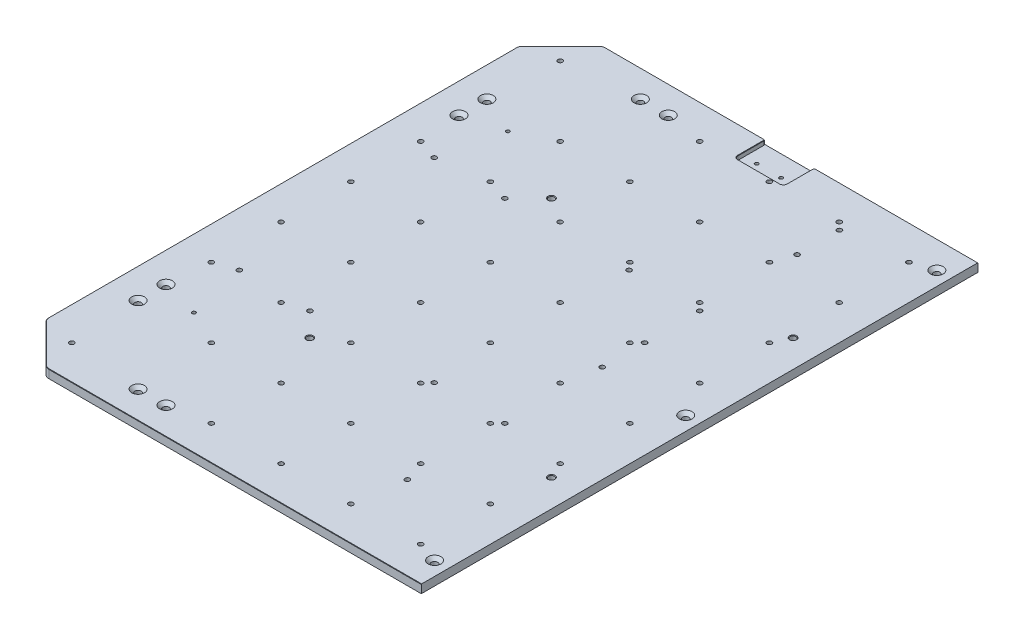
from build123d import *

# Parameters (mm, degrees)
AUFSATZ_LINEAR_AUSTRAGEN1_DEPTH                      = 12
VERRUNDUNG1_R                                        = 10
M8_GEWINDEBOHRUNG2_D                                 = 6.8
M8_GEWINDEBOHRUNG3_D                                 = 6.8
LINEARES_MUSTER1_COUNT                               = 12
LINEARES_MUSTER1_PITCH                               = 100
LINEARES_MUSTER1_COUNT_DIR2                          = 8
LINEARES_MUSTER1_PITCH_DIR2                          = 100
SKIZZE16_R                                           = 6
AUFSATZ_LINEAR_AUSTRAGEN2_DEPTH                      = 12
FORMSENKUNG_F_R_M8_SENKSCHRAUBE_MIT_INNE_D           = 9
FORMSENKUNG_F_R_M8_SENKSCHRAUBE_MIT_INNE_CSINK_D     = 18.25
FORMSENKUNG_F_R_M8_SENKSCHRAUBE_MIT_INNE_CSINK_ANGLE = 90
SCHNITT_LINEAR_AUSTRAGEN1_DEPTH                      = 719.991655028
M5_GEWINDEBOHRUNG1_D                                 = 4.2
M5_GEWINDEBOHRUNG1_DEPTH                             = 12
M5_GEWINDEBOHRUNG1_TIP                               = 1.2618073
SCHNITT_LINEAR_AUSTRAGEN2_DEPTH                      = 6
VERRUNDUNG2_R                                        = 2
M6_GEWINDEBOHRUNG1_D                                 = 5
F_5_0MM_STIFTLOCH1_D                                 = 5
F_5_0MM_STIFTLOCH1_DEPTH                             = 8
F_5_0MM_STIFTLOCH1_TIP                               = 1.502151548
FASE1_SIZE                                           = 0.5
HORST900_MITTE_M8_GEWINDEBOHRUNG13_D                 = 6.8
HORST900_LINKS_M8_GEWINDEBOHRUNG_COUNT               = 2
HORST900_LINKS_M8_GEWINDEBOHRUNG_PITCH               = 279.31
HORST900_MITTE_VORNE_M8_GEWINDEBOHRUNG15_D           = 6.8
LINEARES_MUSTER7_COUNT                               = 2
LINEARES_MUSTER7_PITCH                               = 279.31
LINEARES_MUSTER8_COUNT                               = 2
LINEARES_MUSTER8_PITCH                               = 340
HORST1400_M10_GEWINDEBOHRUNG1_D                      = 8.5
HORST1400_M10_GEWINDEBOHRUNG1_DEPTH                  = 27.5
HORST1400_M10_GEWINDEBOHRUNG1_CSINK_D                = 10.05
HORST1400_M10_GEWINDEBOHRUNG1_CSINK_ANGLE            = 90
HORST1400_M10_GEWINDEBOHRUNG1_TIP                    = 2.553657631


with BuildPart() as part:
    # Skizze1 → Aufsatz-Linear austragen1 (new body)
    with BuildSketch(Plane(origin=(0, 0, 0), x_dir=(1, 0, 0), z_dir=(0, 1, 0))):
        Polygon((-538, 399), (-598, 339), (-598, -339), (-538, -399), (538, -399), (598, -339), (598, 339), (538, 399), align=None)
    extrude(amount=AUFSATZ_LINEAR_AUSTRAGEN1_DEPTH)

    # Verrundung1
    verrundung1_edges = [part.edges().sort_by_distance(p)[0] for p in [
        (598, 6, -339),
        (598, 6, 339),
        (538, 6, 399),
        (-538, 6, 399),
        (-598, 6, 339),
        (-598, 6, -339),
        (-538, 6, -399),
        (538, 6, -399),
    ]]
    fillet(verrundung1_edges, radius=VERRUNDUNG1_R)

    # M8 Gewindebohrung2 (through all)
    with Locations(Plane(origin=(0, 12, 0), x_dir=(1, 0, 0), z_dir=(0, 1, 0))):
        with Locations((520.153589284, -139.653589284), (520.153589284, 139.653589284), (240.846410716, -139.653589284), (240.846410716, 139.653589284)):
            m8_gewindebohrung2 = Hole(M8_GEWINDEBOHRUNG2_D / 2)

    # M8 Gewindebohrung3 (through all)
    with Locations(Plane(origin=(0, 12, 0), x_dir=(1, 0, 0), z_dir=(0, 1, 0))):
        with Locations((-550, -350)):
            m8_gewindebohrung3 = Hole(M8_GEWINDEBOHRUNG3_D / 2)

    # Lineares Muster1: M8 Gewindebohrung3 12 × 8
    with Locations(*[(i * LINEARES_MUSTER1_PITCH, 0, -j * LINEARES_MUSTER1_PITCH_DIR2) for i in range(LINEARES_MUSTER1_COUNT) for j in range(LINEARES_MUSTER1_COUNT_DIR2) if (i, j) != (0, 0)]):
        add(m8_gewindebohrung3, mode=Mode.SUBTRACT)

    # Skizze16 → Aufsatz-Linear austragen2 (add)
    with BuildSketch(Plane(origin=(0, 12, 0), x_dir=(1, 0, 0), z_dir=(0, 1, 0))):
        with Locations((-450, 350)):
            Circle(SKIZZE16_R)
        with Locations((-550, 250)):
            Circle(SKIZZE16_R)
        with Locations((-450, -350)):
            Circle(SKIZZE16_R)
        with Locations((-550, -250)):
            Circle(SKIZZE16_R)
        with Locations((550, -250)):
            Circle(SKIZZE16_R)
        with Locations((450, -350)):
            Circle(SKIZZE16_R)
        with Locations((550, 250)):
            Circle(SKIZZE16_R)
        with Locations((450, 350)):
            Circle(SKIZZE16_R)
    extrude(amount=-AUFSATZ_LINEAR_AUSTRAGEN2_DEPTH)

    # Formsenkung f_r M8 Senkschraube mit Inne (through all)
    with Locations(Plane(origin=(0, 12, 0), x_dir=(1, 0, 0), z_dir=(0, 1, 0))):
        with Locations((-445, 360), (445, -360), (445, 360), (-445, -360), (-555, 210), (-555, -210), (555, 210), (555, -210), (-20, 360), (20, 360), (-20, -360), (20, -360), (-20, 0), (20, 0), (-555, 250), (-555, -250), (555, -250), (555, 250), (-405, 360), (405, 360), (405, -360), (-405, -360)):
            CounterSinkHole(FORMSENKUNG_F_R_M8_SENKSCHRAUBE_MIT_INNE_D / 2, FORMSENKUNG_F_R_M8_SENKSCHRAUBE_MIT_INNE_CSINK_D / 2, counter_sink_angle=FORMSENKUNG_F_R_M8_SENKSCHRAUBE_MIT_INNE_CSINK_ANGLE)

    # Skizze8 → Schnitt-Linear austragen1 (cut, through all)
    with BuildSketch(Plane(origin=(0, 12, 0), x_dir=(1, 0, 0), z_dir=(0, 1, 0))):
        with BuildLine():
            Line((100, 300), (200, 300))
            ThreePointArc((200, 300), (203.535533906, 301.464466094), (205, 305))
            Line((205, 305), (205, 337))
            ThreePointArc((205, 337), (203.535533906, 340.535533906), (200, 342))
            Line((200, 342), (100, 342))
            ThreePointArc((100, 342), (96.464466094, 340.535533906), (95, 337))
            Line((95, 337), (95, 305))
            ThreePointArc((95, 305), (96.464466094, 301.464466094), (100, 300))
        make_face()
    extrude(amount=-SCHNITT_LINEAR_AUSTRAGEN1_DEPTH, mode=Mode.SUBTRACT)

    # M5 Gewindebohrung1
    with Locations(Plane(origin=(0, 12, 0), x_dir=(1, 0, 0), z_dir=(0, 1, 0))):
        with Locations((215, 337), (85, 337), (85, 305), (215, 305)):
            Hole(M5_GEWINDEBOHRUNG1_D / 2, depth=M5_GEWINDEBOHRUNG1_DEPTH)
            with Locations((0, 0, -(M5_GEWINDEBOHRUNG1_DEPTH + M5_GEWINDEBOHRUNG1_TIP / 2))):  # 118° drill point
                Cone(0, M5_GEWINDEBOHRUNG1_D / 2, M5_GEWINDEBOHRUNG1_TIP, mode=Mode.SUBTRACT)

    # Skizze11 → Schnitt-Linear austragen2 (cut)
    with BuildSketch(Plane(origin=(0, 12, 0), x_dir=(1, 0, 0), z_dir=(0, 1, 0))):
        with BuildLine():
            Line((-305.1, 399), (-234.9, 399))
            Line((-234.9, 399), (-234.9, 360))
            ThreePointArc((-234.9, 360), (-236.364466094, 356.464466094), (-239.9, 355))
            Line((-239.9, 355), (-300.1, 355))
            ThreePointArc((-300.1, 355), (-303.635533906, 356.464466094), (-305.1, 360))
            Line((-305.1, 360), (-305.1, 399))
        make_face()
        with BuildLine():
            Line((234.9, 399), (234.9, 360))
            ThreePointArc((234.9, 360), (236.364466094, 356.464466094), (239.9, 355))
            Line((239.9, 355), (300.1, 355))
            ThreePointArc((300.1, 355), (303.635533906, 356.464466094), (305.1, 360))
            Line((305.1, 360), (305.1, 399))
            Line((305.1, 399), (234.9, 399))
        make_face()
    extrude(amount=-SCHNITT_LINEAR_AUSTRAGEN2_DEPTH, mode=Mode.SUBTRACT)

    # Verrundung2
    verrundung2_edges = [part.edges().sort_by_distance(p)[0] for p in [
        (-305.1, 9, -399),
        (-234.9, 9, -399),
        (234.9, 9, -399),
        (305.1, 9, -399),
    ]]
    fillet(verrundung2_edges, radius=VERRUNDUNG2_R)

    # M6 Gewindebohrung1 (through all)
    with Locations(Plane(origin=(0, 6, 0), x_dir=(1, 0, 0), z_dir=(0, 1, 0))):
        with Locations((-287.5, 369.2), (-252.5, 369.2)):
            m6_gewindebohrung1 = Hole(M6_GEWINDEBOHRUNG1_D / 2)

    # Spiegeln3: M8 Gewindebohrung2 across plane
    add(m8_gewindebohrung2.mirror(Plane(origin=(0, 0, 0), x_dir=(0, 0, 1), z_dir=(1, 0, 0))), mode=Mode.SUBTRACT)

    # Spiegeln2: M6 Gewindebohrung1 across plane
    add(m6_gewindebohrung1.mirror(Plane(origin=(0, 0, 0), x_dir=(0, 0, 1), z_dir=(1, 0, 0))), mode=Mode.SUBTRACT)

    # 5.0mm Stiftloch1
    with Locations(Plane(origin=(0, 12, 0), x_dir=(1, 0, 0), z_dir=(0, 1, 0))):
        with Locations((500, 225), (-500, -225), (-500, 225), (500, -225)):
            Hole(F_5_0MM_STIFTLOCH1_D / 2, depth=F_5_0MM_STIFTLOCH1_DEPTH)
            with Locations((0, 0, -(F_5_0MM_STIFTLOCH1_DEPTH + F_5_0MM_STIFTLOCH1_TIP / 2))):  # 118° drill point
                Cone(0, F_5_0MM_STIFTLOCH1_D / 2, F_5_0MM_STIFTLOCH1_TIP, mode=Mode.SUBTRACT)

    # Fase1
    fase1_edges = [part.edges().sort_by_distance(p)[0] for p in [
        (598, 12, 0),
        (568, 12, 369),
        (568, 12, -369),
        (420.478932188, 12, -399),
        (-568, 12, -369),
        (-598, 12, 0),
        (-568, 12, 369),
        (0, 12, 399),
        (537.6846987, 12, -398.238795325),
        (597.238795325, 12, -338.6846987),
        (-537.6846987, 12, -398.238795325),
        (-597.238795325, 12, -338.6846987),
        (-597.238795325, 12, 338.6846987),
        (-537.6846987, 12, 398.238795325),
        (537.6846987, 12, 398.238795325),
        (597.238795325, 12, 338.6846987),
        (96.464466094, 12, -301.464466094),
        (150, 12, -300),
        (203.535533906, 12, -301.464466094),
        (205, 12, -321),
        (203.535533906, 12, -340.535533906),
        (150, 12, -342),
        (96.464466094, 12, -340.535533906),
        (95, 12, -321),
        (-303.635533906, 12, -356.464466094),
        (-270, 12, -355),
        (-236.364466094, 12, -356.464466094),
        (-234.9, 12, -378.5),
        (303.635533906, 12, -356.464466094),
        (305.1, 12, -378.5),
        (236.364466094, 12, -356.464466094),
        (270, 12, -355),
        (0, 12, -399),
        (-420.478932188, 12, -399),
        (234.9, 12, -378.5),
        (-305.1, 12, -378.5),
        (-305.685786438, 12, -398.414213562),
        (-234.314213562, 12, -398.414213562),
        (234.314213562, 12, -398.414213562),
        (305.685786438, 12, -398.414213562),
    ]]
    chamfer(fase1_edges, length=FASE1_SIZE)

    # Abspalten1
    split(bisect_by=Plane(origin=(0, 0, 0), x_dir=(0, 0, 1), z_dir=(1, 0, 0)), keep=Keep.BOTTOM)

    # HORST900 Mitte M8 Gewindebohrung13 (through all)
    with Locations(Plane(origin=(0, 12, 0), x_dir=(1, 0, 0), z_dir=(0, 1, 0))):
        with Locations((139.653589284, 139.653589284), (139.653589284, -139.653589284), (-139.653589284, 139.653589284), (-139.653589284, -139.653589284)):
            horst900_mitte_m8_gewindebohrung13 = Hole(HORST900_MITTE_M8_GEWINDEBOHRUNG13_D / 2)

    # HORST900 Links M8 Gewindebohrung: HORST900 Mitte M8 Gewindebohrung13 ×2
    with Locations(*[(-i * HORST900_LINKS_M8_GEWINDEBOHRUNG_PITCH, 0, 0) for i in range(1, HORST900_LINKS_M8_GEWINDEBOHRUNG_COUNT)]):
        add(horst900_mitte_m8_gewindebohrung13, mode=Mode.SUBTRACT)

    # HORST900 Mitte Vorne M8 Gewindebohrung15 (through all)
    with Locations(Plane(origin=(0, 12, 0), x_dir=(1, 0, 0), z_dir=(0, 1, 0))):
        with Locations((139.653589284, 0), (139.653589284, -279.307178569), (-139.653589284, 0), (-139.653589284, -279.307178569)):
            horst900_mitte_vorne_m8_gewindebohrung15 = Hole(HORST900_MITTE_VORNE_M8_GEWINDEBOHRUNG15_D / 2)

    # Lineares Muster7: HORST900 Mitte Vorne M8 Gewindebohrung15 ×2
    with Locations(*[(0, 0, -i * LINEARES_MUSTER7_PITCH) for i in range(1, LINEARES_MUSTER7_COUNT)]):
        add(horst900_mitte_vorne_m8_gewindebohrung15, mode=Mode.SUBTRACT)

    # Lineares Muster8: HORST900 Mitte Vorne M8 Gewindebohrung15 ×2
    with Locations(*[(0, 0, -i * LINEARES_MUSTER8_PITCH) for i in range(1, LINEARES_MUSTER8_COUNT)]):
        add(horst900_mitte_vorne_m8_gewindebohrung15, mode=Mode.SUBTRACT)

    # HORST1400 M10 Gewindebohrung1
    with Locations(Plane(origin=(0, 12, 0), x_dir=(1, 0, 0), z_dir=(0, 1, 0))):
        with Locations((-385.741161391, -173.241161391), (-39.258838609, -173.241161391), (-385.741161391, 173.241161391), (-39.258838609, 173.241161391)):
            CounterSinkHole(HORST1400_M10_GEWINDEBOHRUNG1_D / 2, HORST1400_M10_GEWINDEBOHRUNG1_CSINK_D / 2, depth=HORST1400_M10_GEWINDEBOHRUNG1_DEPTH, counter_sink_angle=HORST1400_M10_GEWINDEBOHRUNG1_CSINK_ANGLE)
            with Locations((0, 0, -(HORST1400_M10_GEWINDEBOHRUNG1_DEPTH + HORST1400_M10_GEWINDEBOHRUNG1_TIP / 2))):  # 118° drill point
                Cone(0, HORST1400_M10_GEWINDEBOHRUNG1_D / 2, HORST1400_M10_GEWINDEBOHRUNG1_TIP, mode=Mode.SUBTRACT)


solid = part.part
